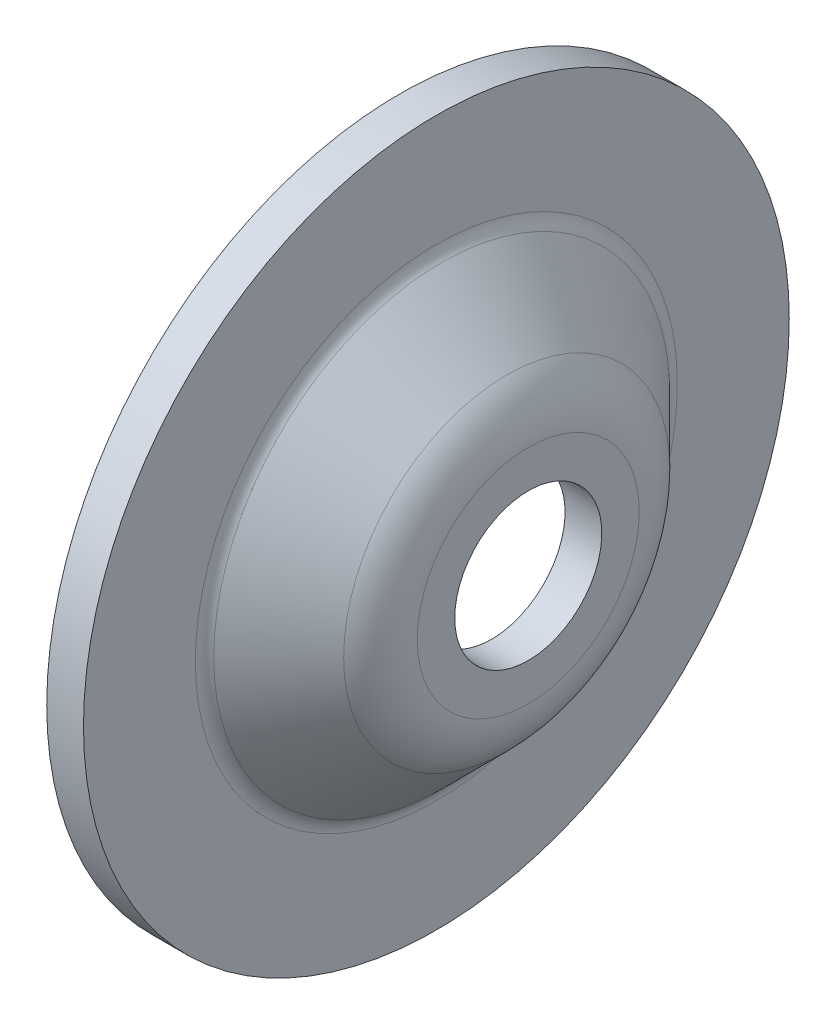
ISO-10303-21;
HEADER;
FILE_DESCRIPTION(('STEP AP214'),'2;1');
FILE_NAME('part.step','',(''),(''),'','','');
FILE_SCHEMA(('AUTOMOTIVE_DESIGN { 1 0 10303 214 1 1 1 1 }'));
ENDSEC;
DATA;
#1=APPLICATION_CONTEXT('core data for automotive mechanical design processes');
#2=APPLICATION_PROTOCOL_DEFINITION('international standard','automotive_design',2000,#1);
#3=PRODUCT_CONTEXT('',#1,'mechanical');
#4=PRODUCT('Part','Part','',(#3));
#5=PRODUCT_RELATED_PRODUCT_CATEGORY('part','',(#4));
#6=PRODUCT_DEFINITION_FORMATION('','',#4);
#7=PRODUCT_DEFINITION_CONTEXT('part definition',#1,'design');
#8=PRODUCT_DEFINITION('design','',#6,#7);
#9=PRODUCT_DEFINITION_SHAPE('','',#8);
#10=(LENGTH_UNIT() NAMED_UNIT(*) SI_UNIT(.MILLI.,.METRE.));
#11=(NAMED_UNIT(*) PLANE_ANGLE_UNIT() SI_UNIT($,.RADIAN.));
#12=(NAMED_UNIT(*) SI_UNIT($,.STERADIAN.) SOLID_ANGLE_UNIT());
#13=UNCERTAINTY_MEASURE_WITH_UNIT(LENGTH_MEASURE(1.E-05),#10,'distance_accuracy_value','');
#14=(GEOMETRIC_REPRESENTATION_CONTEXT(3) GLOBAL_UNCERTAINTY_ASSIGNED_CONTEXT((#13)) GLOBAL_UNIT_ASSIGNED_CONTEXT((#10,
#11,#12)) REPRESENTATION_CONTEXT('',''));
#15=CARTESIAN_POINT('',(0.,0.,0.));
#16=DIRECTION('',(0.,0.,1.));
#17=DIRECTION('',(1.,0.,0.));
#18=AXIS2_PLACEMENT_3D('',#15,#16,#17);
#19=CARTESIAN_POINT('',(-28.,1.66533453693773E-13,-1.11022302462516E-13));
#20=DIRECTION('',(-1.,0.,0.));
#21=DIRECTION('',(0.,0.,1.));
#22=AXIS2_PLACEMENT_3D('',#19,#20,#21);
#23=CYLINDRICAL_SURFACE('',#22,4.);
#24=CARTESIAN_POINT('',(12.,0.,-1.66533453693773E-13));
#25=DIRECTION('',(-1.,0.,0.));
#26=DIRECTION('',(0.,0.,1.));
#27=AXIS2_PLACEMENT_3D('',#24,#25,#26);
#28=CIRCLE('',#27,4.);
#29=CARTESIAN_POINT('',(12.,0.,3.99999999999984));
#30=VERTEX_POINT('',#29);
#31=EDGE_CURVE('E58',#30,#30,#28,.T.);
#32=ORIENTED_EDGE('',*,*,#31,.F.);
#33=EDGE_LOOP('',(#32));
#34=FACE_BOUND('',#33,.T.);
#35=CARTESIAN_POINT('',(10.,0.,-1.66533453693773E-13));
#36=DIRECTION('',(-1.,0.,0.));
#37=DIRECTION('',(0.,0.,1.));
#38=AXIS2_PLACEMENT_3D('',#35,#36,#37);
#39=CIRCLE('',#38,4.);
#40=CARTESIAN_POINT('',(10.,0.,3.99999999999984));
#41=VERTEX_POINT('',#40);
#42=EDGE_CURVE('E67',#41,#41,#39,.T.);
#43=ORIENTED_EDGE('',*,*,#42,.T.);
#44=EDGE_LOOP('',(#43));
#45=FACE_BOUND('',#44,.T.);
#46=ADVANCED_FACE('F27',(#34,#45),#23,.F.);
#47=CARTESIAN_POINT('',(12.0000000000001,4.00000000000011,-1.11022302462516E-13));
#48=DIRECTION('',(-1.,0.,0.));
#49=DIRECTION('',(0.,0.,1.));
#50=AXIS2_PLACEMENT_3D('',#47,#48,#49);
#51=PLANE('',#50);
#52=CARTESIAN_POINT('',(12.,0.,-1.66533453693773E-13));
#53=DIRECTION('',(-1.,0.,0.));
#54=DIRECTION('',(0.,0.,1.));
#55=AXIS2_PLACEMENT_3D('',#52,#53,#54);
#56=CIRCLE('',#55,6.04314575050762);
#57=CARTESIAN_POINT('',(12.,0.,6.04314575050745));
#58=VERTEX_POINT('',#57);
#59=EDGE_CURVE('E46',#58,#58,#56,.F.);
#60=ORIENTED_EDGE('',*,*,#59,.T.);
#61=EDGE_LOOP('',(#60));
#62=FACE_BOUND('',#61,.T.);
#63=ORIENTED_EDGE('',*,*,#31,.T.);
#64=EDGE_LOOP('',(#63));
#65=FACE_BOUND('',#64,.T.);
#66=ADVANCED_FACE('F87',(#62,#65),#51,.F.);
#67=CARTESIAN_POINT('',(12.,0.,-1.66533453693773E-13));
#68=DIRECTION('',(-1.,0.,0.));
#69=DIRECTION('',(0.,0.,1.));
#70=AXIS2_PLACEMENT_3D('',#67,#68,#69);
#71=CONICAL_SURFACE('',#70,7.7,0.785398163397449);
#72=CARTESIAN_POINT('',(10.8284271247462,0.,-1.66533453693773E-13));
#73=DIRECTION('',(1.,0.,0.));
#74=DIRECTION('',(0.,0.,-1.));
#75=AXIS2_PLACEMENT_3D('',#72,#73,#74);
#76=CIRCLE('',#75,8.87157287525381);
#77=CARTESIAN_POINT('',(10.8284271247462,0.,-8.87157287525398));
#78=VERTEX_POINT('',#77);
#79=EDGE_CURVE('E49',#78,#78,#76,.F.);
#80=ORIENTED_EDGE('',*,*,#79,.T.);
#81=EDGE_LOOP('',(#80));
#82=FACE_BOUND('',#81,.T.);
#83=CARTESIAN_POINT('',(7.29289321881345,0.,-1.66533453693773E-13));
#84=DIRECTION('',(-1.,0.,0.));
#85=DIRECTION('',(0.,0.,1.));
#86=AXIS2_PLACEMENT_3D('',#83,#84,#85);
#87=CIRCLE('',#86,12.4071067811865);
#88=CARTESIAN_POINT('',(7.29289321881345,0.,12.4071067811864));
#89=VERTEX_POINT('',#88);
#90=EDGE_CURVE('E52',#89,#89,#87,.F.);
#91=ORIENTED_EDGE('',*,*,#90,.T.);
#92=EDGE_LOOP('',(#91));
#93=FACE_BOUND('',#92,.T.);
#94=ADVANCED_FACE('F92',(#82,#93),#71,.T.);
#95=CARTESIAN_POINT('',(7.00000000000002,12.7000000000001,-1.11022302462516E-13));
#96=DIRECTION('',(-1.,0.,0.));
#97=DIRECTION('',(0.,0.,1.));
#98=AXIS2_PLACEMENT_3D('',#95,#96,#97);
#99=PLANE('',#98);
#100=CARTESIAN_POINT('',(7.00000000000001,0.,-1.66533453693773E-13));
#101=DIRECTION('',(-1.,0.,0.));
#102=DIRECTION('',(0.,0.,1.));
#103=AXIS2_PLACEMENT_3D('',#100,#101,#102);
#104=CIRCLE('',#103,13.1142135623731);
#105=CARTESIAN_POINT('',(7.00000000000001,0.,13.1142135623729));
#106=VERTEX_POINT('',#105);
#107=EDGE_CURVE('E55',#106,#106,#104,.T.);
#108=ORIENTED_EDGE('',*,*,#107,.T.);
#109=EDGE_LOOP('',(#108));
#110=FACE_BOUND('',#109,.T.);
#111=CARTESIAN_POINT('',(7.00000000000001,0.,-1.66533453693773E-13));
#112=DIRECTION('',(-1.,0.,0.));
#113=DIRECTION('',(0.,0.,1.));
#114=AXIS2_PLACEMENT_3D('',#111,#112,#113);
#115=CIRCLE('',#114,19.2);
#116=CARTESIAN_POINT('',(7.00000000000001,0.,19.1999999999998));
#117=VERTEX_POINT('',#116);
#118=EDGE_CURVE('E61',#117,#117,#115,.T.);
#119=ORIENTED_EDGE('',*,*,#118,.F.);
#120=EDGE_LOOP('',(#119));
#121=FACE_BOUND('',#120,.T.);
#122=ADVANCED_FACE('F99',(#110,#121),#99,.F.);
#123=CARTESIAN_POINT('',(-28.,1.66533453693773E-13,-1.11022302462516E-13));
#124=DIRECTION('',(-1.,0.,0.));
#125=DIRECTION('',(0.,0.,1.));
#126=AXIS2_PLACEMENT_3D('',#123,#124,#125);
#127=CYLINDRICAL_SURFACE('',#126,19.2);
#128=CARTESIAN_POINT('',(5.,0.,-1.66533453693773E-13));
#129=DIRECTION('',(-1.,0.,0.));
#130=DIRECTION('',(0.,0.,1.));
#131=AXIS2_PLACEMENT_3D('',#128,#129,#130);
#132=CIRCLE('',#131,19.2);
#133=CARTESIAN_POINT('',(5.,0.,19.1999999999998));
#134=VERTEX_POINT('',#133);
#135=EDGE_CURVE('E64',#134,#134,#132,.T.);
#136=ORIENTED_EDGE('',*,*,#135,.F.);
#137=EDGE_LOOP('',(#136));
#138=FACE_BOUND('',#137,.T.);
#139=ORIENTED_EDGE('',*,*,#118,.T.);
#140=EDGE_LOOP('',(#139));
#141=FACE_BOUND('',#140,.T.);
#142=ADVANCED_FACE('F105',(#138,#141),#127,.T.);
#143=CARTESIAN_POINT('',(5.,19.2,0.));
#144=DIRECTION('',(1.,0.,0.));
#145=DIRECTION('',(0.,0.,-1.));
#146=AXIS2_PLACEMENT_3D('',#143,#144,#145);
#147=PLANE('',#146);
#148=CARTESIAN_POINT('',(5.,0.,-1.66533453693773E-13));
#149=DIRECTION('',(1.,0.,0.));
#150=DIRECTION('',(0.,0.,-1.));
#151=AXIS2_PLACEMENT_3D('',#148,#149,#150);
#152=CIRCLE('',#151,13.5284271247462);
#153=CARTESIAN_POINT('',(5.,0.,-13.5284271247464));
#154=VERTEX_POINT('',#153);
#155=EDGE_CURVE('E37',#154,#154,#152,.T.);
#156=ORIENTED_EDGE('',*,*,#155,.T.);
#157=EDGE_LOOP('',(#156));
#158=FACE_BOUND('',#157,.T.);
#159=ORIENTED_EDGE('',*,*,#135,.T.);
#160=EDGE_LOOP('',(#159));
#161=FACE_BOUND('',#160,.T.);
#162=ADVANCED_FACE('F84',(#158,#161),#147,.F.);
#163=CARTESIAN_POINT('',(5.,0.,-1.66533453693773E-13));
#164=DIRECTION('',(-1.,0.,0.));
#165=DIRECTION('',(0.,0.,1.));
#166=AXIS2_PLACEMENT_3D('',#163,#164,#165);
#167=CONICAL_SURFACE('',#166,11.8715728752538,0.785398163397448);
#168=CARTESIAN_POINT('',(9.70710678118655,0.,-1.66533453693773E-13));
#169=DIRECTION('',(-1.,0.,0.));
#170=DIRECTION('',(0.,0.,1.));
#171=AXIS2_PLACEMENT_3D('',#168,#169,#170);
#172=CIRCLE('',#171,7.16446609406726);
#173=CARTESIAN_POINT('',(9.70710678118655,0.,7.1644660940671));
#174=VERTEX_POINT('',#173);
#175=EDGE_CURVE('E10',#174,#174,#172,.F.);
#176=ORIENTED_EDGE('',*,*,#175,.T.);
#177=EDGE_LOOP('',(#176));
#178=FACE_BOUND('',#177,.T.);
#179=CARTESIAN_POINT('',(6.17157287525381,0.,-1.66533453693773E-13));
#180=DIRECTION('',(1.,0.,0.));
#181=DIRECTION('',(0.,0.,-1.));
#182=AXIS2_PLACEMENT_3D('',#179,#180,#181);
#183=CIRCLE('',#182,10.7);
#184=CARTESIAN_POINT('',(6.17157287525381,0.,-10.7000000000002));
#185=VERTEX_POINT('',#184);
#186=EDGE_CURVE('E41',#185,#185,#183,.F.);
#187=ORIENTED_EDGE('',*,*,#186,.T.);
#188=EDGE_LOOP('',(#187));
#189=FACE_BOUND('',#188,.T.);
#190=ADVANCED_FACE('F75',(#178,#189),#167,.F.);
#191=CARTESIAN_POINT('',(10.0000000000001,6.87157287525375,0.));
#192=DIRECTION('',(1.,0.,0.));
#193=DIRECTION('',(0.,0.,-1.));
#194=AXIS2_PLACEMENT_3D('',#191,#192,#193);
#195=PLANE('',#194);
#196=CARTESIAN_POINT('',(10.,0.,-1.66533453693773E-13));
#197=DIRECTION('',(1.,0.,0.));
#198=DIRECTION('',(0.,0.,-1.));
#199=AXIS2_PLACEMENT_3D('',#196,#197,#198);
#200=CIRCLE('',#199,6.45735931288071);
#201=CARTESIAN_POINT('',(10.,0.,-6.45735931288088));
#202=VERTEX_POINT('',#201);
#203=EDGE_CURVE('E33',#202,#202,#200,.F.);
#204=ORIENTED_EDGE('',*,*,#203,.T.);
#205=EDGE_LOOP('',(#204));
#206=FACE_BOUND('',#205,.T.);
#207=ORIENTED_EDGE('',*,*,#42,.F.);
#208=EDGE_LOOP('',(#207));
#209=FACE_BOUND('',#208,.T.);
#210=ADVANCED_FACE('F72',(#206,#209),#195,.F.);
#211=CARTESIAN_POINT('',(8.00000000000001,0.,-1.66533453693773E-13));
#212=DIRECTION('',(-1.,0.,0.));
#213=DIRECTION('',(0.,0.,1.));
#214=AXIS2_PLACEMENT_3D('',#211,#212,#213);
#215=TOROIDAL_SURFACE('',#214,13.1142135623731,1.);
#216=ORIENTED_EDGE('',*,*,#90,.F.);
#217=EDGE_LOOP('',(#216));
#218=FACE_BOUND('',#217,.T.);
#219=ORIENTED_EDGE('',*,*,#107,.F.);
#220=EDGE_LOOP('',(#219));
#221=FACE_BOUND('',#220,.T.);
#222=ADVANCED_FACE('F74',(#218,#221),#215,.F.);
#223=CARTESIAN_POINT('',(8.00000000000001,0.,-1.66533453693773E-13));
#224=DIRECTION('',(-1.,0.,0.));
#225=DIRECTION('',(0.,0.,1.));
#226=AXIS2_PLACEMENT_3D('',#223,#224,#225);
#227=TOROIDAL_SURFACE('',#226,6.04314575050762,4.);
#228=ORIENTED_EDGE('',*,*,#59,.F.);
#229=EDGE_LOOP('',(#228));
#230=FACE_BOUND('',#229,.T.);
#231=ORIENTED_EDGE('',*,*,#79,.F.);
#232=EDGE_LOOP('',(#231));
#233=FACE_BOUND('',#232,.T.);
#234=ADVANCED_FACE('F81',(#230,#233),#227,.T.);
#235=CARTESIAN_POINT('',(9.00000000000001,0.,-1.66533453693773E-13));
#236=DIRECTION('',(1.,0.,0.));
#237=DIRECTION('',(0.,0.,-1.));
#238=AXIS2_PLACEMENT_3D('',#235,#236,#237);
#239=TOROIDAL_SURFACE('',#238,13.5284271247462,4.);
#240=ORIENTED_EDGE('',*,*,#155,.F.);
#241=EDGE_LOOP('',(#240));
#242=FACE_BOUND('',#241,.T.);
#243=ORIENTED_EDGE('',*,*,#186,.F.);
#244=EDGE_LOOP('',(#243));
#245=FACE_BOUND('',#244,.T.);
#246=ADVANCED_FACE('F121',(#242,#245),#239,.T.);
#247=CARTESIAN_POINT('',(9.00000000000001,0.,-1.66533453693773E-13));
#248=DIRECTION('',(1.,0.,0.));
#249=DIRECTION('',(0.,0.,-1.));
#250=AXIS2_PLACEMENT_3D('',#247,#248,#249);
#251=TOROIDAL_SURFACE('',#250,6.45735931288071,1.);
#252=ORIENTED_EDGE('',*,*,#175,.F.);
#253=EDGE_LOOP('',(#252));
#254=FACE_BOUND('',#253,.T.);
#255=ORIENTED_EDGE('',*,*,#203,.F.);
#256=EDGE_LOOP('',(#255));
#257=FACE_BOUND('',#256,.T.);
#258=ADVANCED_FACE('F124',(#254,#257),#251,.F.);
#259=CLOSED_SHELL('',(#46,#66,#94,#122,#142,#162,#190,#210,#222,#234,#246,#258));
#260=MANIFOLD_SOLID_BREP('B2',#259);
#261=ADVANCED_BREP_SHAPE_REPRESENTATION('',(#18,#260),#14);
#262=SHAPE_DEFINITION_REPRESENTATION(#9,#261);
ENDSEC;
END-ISO-10303-21;
